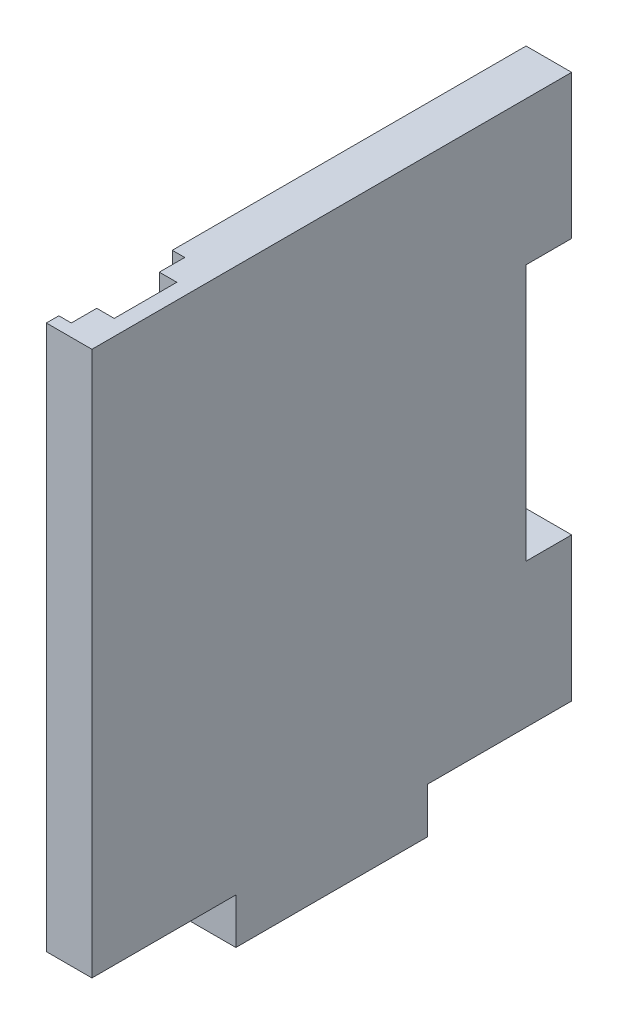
ISO-10303-21;
HEADER;
FILE_DESCRIPTION(('STEP AP214'),'2;1');
FILE_NAME('part.step','',(''),(''),'','','');
FILE_SCHEMA(('AUTOMOTIVE_DESIGN { 1 0 10303 214 1 1 1 1 }'));
ENDSEC;
DATA;
#1=APPLICATION_CONTEXT('core data for automotive mechanical design processes');
#2=APPLICATION_PROTOCOL_DEFINITION('international standard','automotive_design',2000,#1);
#3=PRODUCT_CONTEXT('',#1,'mechanical');
#4=PRODUCT('Part','Part','',(#3));
#5=PRODUCT_RELATED_PRODUCT_CATEGORY('part','',(#4));
#6=PRODUCT_DEFINITION_FORMATION('','',#4);
#7=PRODUCT_DEFINITION_CONTEXT('part definition',#1,'design');
#8=PRODUCT_DEFINITION('design','',#6,#7);
#9=PRODUCT_DEFINITION_SHAPE('','',#8);
#10=(LENGTH_UNIT() NAMED_UNIT(*) SI_UNIT(.MILLI.,.METRE.));
#11=(NAMED_UNIT(*) PLANE_ANGLE_UNIT() SI_UNIT($,.RADIAN.));
#12=(NAMED_UNIT(*) SI_UNIT($,.STERADIAN.) SOLID_ANGLE_UNIT());
#13=UNCERTAINTY_MEASURE_WITH_UNIT(LENGTH_MEASURE(1.E-05),#10,'distance_accuracy_value','');
#14=(GEOMETRIC_REPRESENTATION_CONTEXT(3) GLOBAL_UNCERTAINTY_ASSIGNED_CONTEXT((#13)) GLOBAL_UNIT_ASSIGNED_CONTEXT((#10,
#11,#12)) REPRESENTATION_CONTEXT('',''));
#15=CARTESIAN_POINT('',(0.,0.,0.));
#16=DIRECTION('',(0.,0.,1.));
#17=DIRECTION('',(1.,0.,0.));
#18=AXIS2_PLACEMENT_3D('',#15,#16,#17);
#19=CARTESIAN_POINT('',(-4.3,0.,0.));
#20=DIRECTION('',(-1.,0.,0.));
#21=DIRECTION('',(0.,0.,1.));
#22=AXIS2_PLACEMENT_3D('',#19,#20,#21);
#23=PLANE('',#22);
#24=DIRECTION('',(0.,1.,0.));
#25=VECTOR('',#24,1.);
#26=CARTESIAN_POINT('',(-4.3,0.,84.2));
#27=LINE('',#26,#25);
#28=CARTESIAN_POINT('',(-4.3,-104.,84.2));
#29=VERTEX_POINT('',#28);
#30=CARTESIAN_POINT('',(-4.3,123.,84.2));
#31=VERTEX_POINT('',#30);
#32=EDGE_CURVE('E11',#29,#31,#27,.T.);
#33=ORIENTED_EDGE('',*,*,#32,.F.);
#34=DIRECTION('',(0.,0.,1.));
#35=VECTOR('',#34,1.);
#36=CARTESIAN_POINT('',(-4.3,-104.,47.5000000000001));
#37=LINE('',#36,#35);
#38=CARTESIAN_POINT('',(-4.3,-104.,94.8000000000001));
#39=VERTEX_POINT('',#38);
#40=EDGE_CURVE('E203',#29,#39,#37,.T.);
#41=ORIENTED_EDGE('',*,*,#40,.T.);
#42=DIRECTION('',(0.,1.,0.));
#43=VECTOR('',#42,1.);
#44=CARTESIAN_POINT('',(-4.3,123.,94.8));
#45=LINE('',#44,#43);
#46=CARTESIAN_POINT('',(-4.3,123.,94.8));
#47=VERTEX_POINT('',#46);
#48=EDGE_CURVE('E207',#39,#47,#45,.T.);
#49=ORIENTED_EDGE('',*,*,#48,.T.);
#50=DIRECTION('',(0.,0.,-1.));
#51=VECTOR('',#50,1.);
#52=CARTESIAN_POINT('',(-4.3,123.,47.5));
#53=LINE('',#52,#51);
#54=EDGE_CURVE('E211',#47,#31,#53,.T.);
#55=ORIENTED_EDGE('',*,*,#54,.T.);
#56=EDGE_LOOP('',(#33,#41,#49,#55));
#57=FACE_BOUND('',#56,.T.);
#58=ADVANCED_FACE('F32',(#57),#23,.T.);
#59=CARTESIAN_POINT('',(-9.5,0.,0.));
#60=DIRECTION('',(1.,0.,0.));
#61=DIRECTION('',(0.,0.,-1.));
#62=AXIS2_PLACEMENT_3D('',#59,#60,#61);
#63=PLANE('',#62);
#64=DIRECTION('',(0.,0.,1.));
#65=VECTOR('',#64,1.);
#66=CARTESIAN_POINT('',(-9.5,-104.,100.));
#67=LINE('',#66,#65);
#68=CARTESIAN_POINT('',(-9.5,-104.,40.));
#69=VERTEX_POINT('',#68);
#70=CARTESIAN_POINT('',(-9.5,-104.,47.5000000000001));
#71=VERTEX_POINT('',#70);
#72=EDGE_CURVE('E229',#69,#71,#67,.T.);
#73=ORIENTED_EDGE('',*,*,#72,.T.);
#74=DIRECTION('',(0.,-1.,0.));
#75=VECTOR('',#74,1.);
#76=CARTESIAN_POINT('',(-9.5,123.,47.5));
#77=LINE('',#76,#75);
#78=CARTESIAN_POINT('',(-9.5,123.,47.5));
#79=VERTEX_POINT('',#78);
#80=EDGE_CURVE('E197',#79,#71,#77,.T.);
#81=ORIENTED_EDGE('',*,*,#80,.F.);
#82=DIRECTION('',(0.,0.,1.));
#83=VECTOR('',#82,1.);
#84=CARTESIAN_POINT('',(-9.5,123.,100.));
#85=LINE('',#84,#83);
#86=CARTESIAN_POINT('',(-9.5,123.,-100.));
#87=VERTEX_POINT('',#86);
#88=EDGE_CURVE('E302',#87,#79,#85,.T.);
#89=ORIENTED_EDGE('',*,*,#88,.F.);
#90=DIRECTION('',(0.,1.,0.));
#91=VECTOR('',#90,1.);
#92=CARTESIAN_POINT('',(-9.5,123.,-100.));
#93=LINE('',#92,#91);
#94=CARTESIAN_POINT('',(-9.5,63.,-100.));
#95=VERTEX_POINT('',#94);
#96=EDGE_CURVE('E287',#95,#87,#93,.T.);
#97=ORIENTED_EDGE('',*,*,#96,.F.);
#98=DIRECTION('',(0.,0.,-1.));
#99=VECTOR('',#98,1.);
#100=CARTESIAN_POINT('',(-9.5,63.,-100.));
#101=LINE('',#100,#99);
#102=CARTESIAN_POINT('',(-9.5,63.,-81.));
#103=VERTEX_POINT('',#102);
#104=EDGE_CURVE('E280',#103,#95,#101,.T.);
#105=ORIENTED_EDGE('',*,*,#104,.F.);
#106=DIRECTION('',(0.,1.,0.));
#107=VECTOR('',#106,1.);
#108=CARTESIAN_POINT('',(-9.5,63.,-81.));
#109=LINE('',#108,#107);
#110=CARTESIAN_POINT('',(-9.5,-44.,-81.));
#111=VERTEX_POINT('',#110);
#112=EDGE_CURVE('E262',#111,#103,#109,.T.);
#113=ORIENTED_EDGE('',*,*,#112,.F.);
#114=DIRECTION('',(0.,0.,1.));
#115=VECTOR('',#114,1.);
#116=CARTESIAN_POINT('',(-9.5,-44.,-100.));
#117=LINE('',#116,#115);
#118=CARTESIAN_POINT('',(-9.5,-44.,-100.));
#119=VERTEX_POINT('',#118);
#120=EDGE_CURVE('E264',#119,#111,#117,.T.);
#121=ORIENTED_EDGE('',*,*,#120,.F.);
#122=CARTESIAN_POINT('',(-9.5,-104.,-100.));
#123=VERTEX_POINT('',#122);
#124=EDGE_CURVE('E299',#123,#119,#93,.T.);
#125=ORIENTED_EDGE('',*,*,#124,.F.);
#126=DIRECTION('',(0.,0.,-1.));
#127=VECTOR('',#126,1.);
#128=CARTESIAN_POINT('',(-9.5,-104.,-100.));
#129=LINE('',#128,#127);
#130=CARTESIAN_POINT('',(-9.5,-104.,-40.));
#131=VERTEX_POINT('',#130);
#132=EDGE_CURVE('E257',#131,#123,#129,.T.);
#133=ORIENTED_EDGE('',*,*,#132,.F.);
#134=DIRECTION('',(0.,1.,0.));
#135=VECTOR('',#134,1.);
#136=CARTESIAN_POINT('',(-9.5,-123.,-40.));
#137=LINE('',#136,#135);
#138=CARTESIAN_POINT('',(-9.5,-123.,-40.));
#139=VERTEX_POINT('',#138);
#140=EDGE_CURVE('E242',#139,#131,#137,.T.);
#141=ORIENTED_EDGE('',*,*,#140,.F.);
#142=DIRECTION('',(0.,0.,-1.));
#143=VECTOR('',#142,1.);
#144=CARTESIAN_POINT('',(-9.5,-123.,100.));
#145=LINE('',#144,#143);
#146=CARTESIAN_POINT('',(-9.5,-123.,40.));
#147=VERTEX_POINT('',#146);
#148=EDGE_CURVE('E308',#147,#139,#145,.T.);
#149=ORIENTED_EDGE('',*,*,#148,.F.);
#150=DIRECTION('',(0.,1.,0.));
#151=VECTOR('',#150,1.);
#152=CARTESIAN_POINT('',(-9.5,-123.,40.));
#153=LINE('',#152,#151);
#154=EDGE_CURVE('E218',#147,#69,#153,.T.);
#155=ORIENTED_EDGE('',*,*,#154,.T.);
#156=EDGE_LOOP('',(#73,#81,#89,#97,#105,#113,#121,#125,#133,#141,#149,#155));
#157=FACE_BOUND('',#156,.T.);
#158=ADVANCED_FACE('F331',(#157),#63,.F.);
#159=CARTESIAN_POINT('',(9.5,123.,100.));
#160=DIRECTION('',(0.,0.,-1.));
#161=DIRECTION('',(0.,1.,0.));
#162=AXIS2_PLACEMENT_3D('',#159,#160,#161);
#163=PLANE('',#162);
#164=DIRECTION('',(1.,0.,0.));
#165=VECTOR('',#164,1.);
#166=CARTESIAN_POINT('',(-9.501,-104.,100.));
#167=LINE('',#166,#165);
#168=CARTESIAN_POINT('',(-9.5,-104.,100.));
#169=VERTEX_POINT('',#168);
#170=CARTESIAN_POINT('',(9.5,-104.,100.));
#171=VERTEX_POINT('',#170);
#172=EDGE_CURVE('E239',#169,#171,#167,.T.);
#173=ORIENTED_EDGE('',*,*,#172,.T.);
#174=DIRECTION('',(0.,-1.,0.));
#175=VECTOR('',#174,1.);
#176=CARTESIAN_POINT('',(9.5,123.,100.));
#177=LINE('',#176,#175);
#178=CARTESIAN_POINT('',(9.5,123.,100.));
#179=VERTEX_POINT('',#178);
#180=EDGE_CURVE('E293',#179,#171,#177,.T.);
#181=ORIENTED_EDGE('',*,*,#180,.F.);
#182=DIRECTION('',(-1.,0.,0.));
#183=VECTOR('',#182,1.);
#184=CARTESIAN_POINT('',(9.5,123.,100.));
#185=LINE('',#184,#183);
#186=CARTESIAN_POINT('',(-9.5,123.,100.));
#187=VERTEX_POINT('',#186);
#188=EDGE_CURVE('E298',#179,#187,#185,.T.);
#189=ORIENTED_EDGE('',*,*,#188,.T.);
#190=DIRECTION('',(0.,-1.,0.));
#191=VECTOR('',#190,1.);
#192=CARTESIAN_POINT('',(-9.5,123.,100.));
#193=LINE('',#192,#191);
#194=EDGE_CURVE('E305',#187,#169,#193,.T.);
#195=ORIENTED_EDGE('',*,*,#194,.T.);
#196=EDGE_LOOP('',(#173,#181,#189,#195));
#197=FACE_BOUND('',#196,.T.);
#198=ADVANCED_FACE('F336',(#197),#163,.F.);
#199=CARTESIAN_POINT('',(9.5,-123.,100.));
#200=DIRECTION('',(0.,1.,0.));
#201=DIRECTION('',(0.,0.,1.));
#202=AXIS2_PLACEMENT_3D('',#199,#200,#201);
#203=PLANE('',#202);
#204=DIRECTION('',(1.,0.,0.));
#205=VECTOR('',#204,1.);
#206=CARTESIAN_POINT('',(-9.501,-123.,40.));
#207=LINE('',#206,#205);
#208=CARTESIAN_POINT('',(9.5,-123.,40.));
#209=VERTEX_POINT('',#208);
#210=EDGE_CURVE('E238',#147,#209,#207,.T.);
#211=ORIENTED_EDGE('',*,*,#210,.F.);
#212=ORIENTED_EDGE('',*,*,#148,.T.);
#213=DIRECTION('',(1.,0.,0.));
#214=VECTOR('',#213,1.);
#215=CARTESIAN_POINT('',(-9.501,-123.,-40.));
#216=LINE('',#215,#214);
#217=CARTESIAN_POINT('',(9.5,-123.,-40.));
#218=VERTEX_POINT('',#217);
#219=EDGE_CURVE('E254',#139,#218,#216,.T.);
#220=ORIENTED_EDGE('',*,*,#219,.T.);
#221=DIRECTION('',(0.,0.,-1.));
#222=VECTOR('',#221,1.);
#223=CARTESIAN_POINT('',(9.5,-123.,100.));
#224=LINE('',#223,#222);
#225=EDGE_CURVE('E296',#209,#218,#224,.T.);
#226=ORIENTED_EDGE('',*,*,#225,.F.);
#227=EDGE_LOOP('',(#211,#212,#220,#226));
#228=FACE_BOUND('',#227,.T.);
#229=ADVANCED_FACE('F375',(#228),#203,.F.);
#230=CARTESIAN_POINT('',(9.5,0.,0.));
#231=DIRECTION('',(1.,0.,0.));
#232=DIRECTION('',(0.,0.,-1.));
#233=AXIS2_PLACEMENT_3D('',#230,#231,#232);
#234=PLANE('',#233);
#235=ORIENTED_EDGE('',*,*,#180,.T.);
#236=DIRECTION('',(0.,0.,-1.));
#237=VECTOR('',#236,1.);
#238=CARTESIAN_POINT('',(9.5,-104.,100.));
#239=LINE('',#238,#237);
#240=CARTESIAN_POINT('',(9.5,-104.,40.));
#241=VERTEX_POINT('',#240);
#242=EDGE_CURVE('E235',#171,#241,#239,.T.);
#243=ORIENTED_EDGE('',*,*,#242,.T.);
#244=DIRECTION('',(0.,-1.,0.));
#245=VECTOR('',#244,1.);
#246=CARTESIAN_POINT('',(9.5,-123.,40.));
#247=LINE('',#246,#245);
#248=EDGE_CURVE('E232',#241,#209,#247,.T.);
#249=ORIENTED_EDGE('',*,*,#248,.T.);
#250=ORIENTED_EDGE('',*,*,#225,.T.);
#251=DIRECTION('',(0.,-1.,0.));
#252=VECTOR('',#251,1.);
#253=CARTESIAN_POINT('',(9.5,-123.,-40.));
#254=LINE('',#253,#252);
#255=CARTESIAN_POINT('',(9.5,-104.,-40.));
#256=VERTEX_POINT('',#255);
#257=EDGE_CURVE('E250',#256,#218,#254,.T.);
#258=ORIENTED_EDGE('',*,*,#257,.F.);
#259=DIRECTION('',(0.,0.,1.));
#260=VECTOR('',#259,1.);
#261=CARTESIAN_POINT('',(9.5,-104.,-100.));
#262=LINE('',#261,#260);
#263=CARTESIAN_POINT('',(9.5,-104.,-100.));
#264=VERTEX_POINT('',#263);
#265=EDGE_CURVE('E247',#264,#256,#262,.T.);
#266=ORIENTED_EDGE('',*,*,#265,.F.);
#267=DIRECTION('',(0.,1.,0.));
#268=VECTOR('',#267,1.);
#269=CARTESIAN_POINT('',(9.5,123.,-100.));
#270=LINE('',#269,#268);
#271=CARTESIAN_POINT('',(9.5,-44.,-100.));
#272=VERTEX_POINT('',#271);
#273=EDGE_CURVE('E288',#264,#272,#270,.T.);
#274=ORIENTED_EDGE('',*,*,#273,.T.);
#275=DIRECTION('',(0.,0.,-1.));
#276=VECTOR('',#275,1.);
#277=CARTESIAN_POINT('',(9.5,-44.,-100.));
#278=LINE('',#277,#276);
#279=CARTESIAN_POINT('',(9.5,-44.,-81.));
#280=VERTEX_POINT('',#279);
#281=EDGE_CURVE('E273',#280,#272,#278,.T.);
#282=ORIENTED_EDGE('',*,*,#281,.F.);
#283=DIRECTION('',(0.,-1.,0.));
#284=VECTOR('',#283,1.);
#285=CARTESIAN_POINT('',(9.5,63.,-81.));
#286=LINE('',#285,#284);
#287=CARTESIAN_POINT('',(9.5,63.,-81.));
#288=VERTEX_POINT('',#287);
#289=EDGE_CURVE('E270',#288,#280,#286,.T.);
#290=ORIENTED_EDGE('',*,*,#289,.F.);
#291=DIRECTION('',(0.,0.,1.));
#292=VECTOR('',#291,1.);
#293=CARTESIAN_POINT('',(9.5,63.,-100.));
#294=LINE('',#293,#292);
#295=CARTESIAN_POINT('',(9.5,63.,-100.));
#296=VERTEX_POINT('',#295);
#297=EDGE_CURVE('E267',#296,#288,#294,.T.);
#298=ORIENTED_EDGE('',*,*,#297,.F.);
#299=CARTESIAN_POINT('',(9.5,123.,-100.));
#300=VERTEX_POINT('',#299);
#301=EDGE_CURVE('E291',#296,#300,#270,.T.);
#302=ORIENTED_EDGE('',*,*,#301,.T.);
#303=DIRECTION('',(0.,0.,1.));
#304=VECTOR('',#303,1.);
#305=CARTESIAN_POINT('',(9.5,123.,100.));
#306=LINE('',#305,#304);
#307=EDGE_CURVE('E290',#300,#179,#306,.T.);
#308=ORIENTED_EDGE('',*,*,#307,.T.);
#309=EDGE_LOOP('',(#235,#243,#249,#250,#258,#266,#274,#282,#290,#298,#302,#308));
#310=FACE_BOUND('',#309,.T.);
#311=ADVANCED_FACE('F354',(#310),#234,.T.);
#312=CARTESIAN_POINT('',(-9.5,123.,94.8));
#313=VERTEX_POINT('',#312);
#314=EDGE_CURVE('E301',#313,#187,#85,.T.);
#315=ORIENTED_EDGE('',*,*,#314,.F.);
#316=DIRECTION('',(0.,1.,0.));
#317=VECTOR('',#316,1.);
#318=CARTESIAN_POINT('',(-9.5,123.,94.8));
#319=LINE('',#318,#317);
#320=CARTESIAN_POINT('',(-9.5,-104.,94.8000000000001));
#321=VERTEX_POINT('',#320);
#322=EDGE_CURVE('E204',#321,#313,#319,.T.);
#323=ORIENTED_EDGE('',*,*,#322,.F.);
#324=EDGE_CURVE('E228',#321,#169,#67,.T.);
#325=ORIENTED_EDGE('',*,*,#324,.T.);
#326=ORIENTED_EDGE('',*,*,#194,.F.);
#327=EDGE_LOOP('',(#315,#323,#325,#326));
#328=FACE_BOUND('',#327,.T.);
#329=ADVANCED_FACE('F339',(#328),#63,.F.);
#330=CARTESIAN_POINT('',(9.5,123.,-100.));
#331=DIRECTION('',(0.,0.,1.));
#332=DIRECTION('',(0.,-1.,0.));
#333=AXIS2_PLACEMENT_3D('',#330,#331,#332);
#334=PLANE('',#333);
#335=ORIENTED_EDGE('',*,*,#273,.F.);
#336=DIRECTION('',(1.,0.,0.));
#337=VECTOR('',#336,1.);
#338=CARTESIAN_POINT('',(-9.501,-104.,-100.));
#339=LINE('',#338,#337);
#340=EDGE_CURVE('E253',#123,#264,#339,.T.);
#341=ORIENTED_EDGE('',*,*,#340,.F.);
#342=ORIENTED_EDGE('',*,*,#124,.T.);
#343=DIRECTION('',(1.,0.,0.));
#344=VECTOR('',#343,1.);
#345=CARTESIAN_POINT('',(-9.501,-44.,-100.));
#346=LINE('',#345,#344);
#347=EDGE_CURVE('E277',#119,#272,#346,.T.);
#348=ORIENTED_EDGE('',*,*,#347,.T.);
#349=EDGE_LOOP('',(#335,#341,#342,#348));
#350=FACE_BOUND('',#349,.T.);
#351=ADVANCED_FACE('F389',(#350),#334,.F.);
#352=ORIENTED_EDGE('',*,*,#301,.F.);
#353=DIRECTION('',(1.,0.,0.));
#354=VECTOR('',#353,1.);
#355=CARTESIAN_POINT('',(-9.501,63.,-100.));
#356=LINE('',#355,#354);
#357=EDGE_CURVE('E276',#95,#296,#356,.T.);
#358=ORIENTED_EDGE('',*,*,#357,.F.);
#359=ORIENTED_EDGE('',*,*,#96,.T.);
#360=DIRECTION('',(-1.,0.,0.));
#361=VECTOR('',#360,1.);
#362=CARTESIAN_POINT('',(9.5,123.,-100.));
#363=LINE('',#362,#361);
#364=EDGE_CURVE('E312',#300,#87,#363,.T.);
#365=ORIENTED_EDGE('',*,*,#364,.F.);
#366=EDGE_LOOP('',(#352,#358,#359,#365));
#367=FACE_BOUND('',#366,.T.);
#368=ADVANCED_FACE('F34',(#367),#334,.F.);
#369=CARTESIAN_POINT('',(9.5,123.,100.));
#370=DIRECTION('',(0.,-1.,0.));
#371=DIRECTION('',(0.,0.,-1.));
#372=AXIS2_PLACEMENT_3D('',#369,#370,#371);
#373=PLANE('',#372);
#374=DIRECTION('',(0.,0.,-1.));
#375=VECTOR('',#374,1.);
#376=CARTESIAN_POINT('',(3.,123.,84.2));
#377=LINE('',#376,#375);
#378=CARTESIAN_POINT('',(3.,123.,84.2));
#379=VERTEX_POINT('',#378);
#380=CARTESIAN_POINT('',(3.,123.,58.1));
#381=VERTEX_POINT('',#380);
#382=EDGE_CURVE('E184',#379,#381,#377,.T.);
#383=ORIENTED_EDGE('',*,*,#382,.F.);
#384=DIRECTION('',(-1.,0.,0.));
#385=VECTOR('',#384,1.);
#386=CARTESIAN_POINT('',(3.,123.,84.2));
#387=LINE('',#386,#385);
#388=EDGE_CURVE('E168',#379,#31,#387,.T.);
#389=ORIENTED_EDGE('',*,*,#388,.T.);
#390=ORIENTED_EDGE('',*,*,#54,.F.);
#391=DIRECTION('',(-1.,0.,0.));
#392=VECTOR('',#391,1.);
#393=CARTESIAN_POINT('',(-4.3,123.,94.8));
#394=LINE('',#393,#392);
#395=EDGE_CURVE('E219',#47,#313,#394,.T.);
#396=ORIENTED_EDGE('',*,*,#395,.T.);
#397=ORIENTED_EDGE('',*,*,#314,.T.);
#398=ORIENTED_EDGE('',*,*,#188,.F.);
#399=ORIENTED_EDGE('',*,*,#307,.F.);
#400=ORIENTED_EDGE('',*,*,#364,.T.);
#401=ORIENTED_EDGE('',*,*,#88,.T.);
#402=DIRECTION('',(-1.,0.,0.));
#403=VECTOR('',#402,1.);
#404=CARTESIAN_POINT('',(-4.3,123.,47.5));
#405=LINE('',#404,#403);
#406=CARTESIAN_POINT('',(-4.3,123.,47.5));
#407=VERTEX_POINT('',#406);
#408=EDGE_CURVE('E216',#407,#79,#405,.T.);
#409=ORIENTED_EDGE('',*,*,#408,.F.);
#410=CARTESIAN_POINT('',(-4.3,123.,58.1));
#411=VERTEX_POINT('',#410);
#412=EDGE_CURVE('E210',#411,#407,#53,.T.);
#413=ORIENTED_EDGE('',*,*,#412,.F.);
#414=DIRECTION('',(-1.,0.,0.));
#415=VECTOR('',#414,1.);
#416=CARTESIAN_POINT('',(3.,123.,58.1));
#417=LINE('',#416,#415);
#418=EDGE_CURVE('E47',#381,#411,#417,.T.);
#419=ORIENTED_EDGE('',*,*,#418,.F.);
#420=EDGE_LOOP('',(#383,#389,#390,#396,#397,#398,#399,#400,#401,#409,#413,#419));
#421=FACE_BOUND('',#420,.T.);
#422=ADVANCED_FACE('F188',(#421),#373,.F.);
#423=CARTESIAN_POINT('',(-9.501,-44.,-100.));
#424=DIRECTION('',(0.,-1.,0.));
#425=DIRECTION('',(0.,0.,-1.));
#426=AXIS2_PLACEMENT_3D('',#423,#424,#425);
#427=PLANE('',#426);
#428=ORIENTED_EDGE('',*,*,#120,.T.);
#429=DIRECTION('',(1.,0.,0.));
#430=VECTOR('',#429,1.);
#431=CARTESIAN_POINT('',(-9.501,-44.,-81.));
#432=LINE('',#431,#430);
#433=EDGE_CURVE('E281',#111,#280,#432,.T.);
#434=ORIENTED_EDGE('',*,*,#433,.T.);
#435=ORIENTED_EDGE('',*,*,#281,.T.);
#436=ORIENTED_EDGE('',*,*,#347,.F.);
#437=EDGE_LOOP('',(#428,#434,#435,#436));
#438=FACE_BOUND('',#437,.T.);
#439=ADVANCED_FACE('F394',(#438),#427,.F.);
#440=CARTESIAN_POINT('',(-9.501,63.,-81.));
#441=DIRECTION('',(0.,0.,1.));
#442=DIRECTION('',(0.,-1.,0.));
#443=AXIS2_PLACEMENT_3D('',#440,#441,#442);
#444=PLANE('',#443);
#445=ORIENTED_EDGE('',*,*,#112,.T.);
#446=DIRECTION('',(1.,0.,0.));
#447=VECTOR('',#446,1.);
#448=CARTESIAN_POINT('',(-9.501,63.,-81.));
#449=LINE('',#448,#447);
#450=EDGE_CURVE('E283',#103,#288,#449,.T.);
#451=ORIENTED_EDGE('',*,*,#450,.T.);
#452=ORIENTED_EDGE('',*,*,#289,.T.);
#453=ORIENTED_EDGE('',*,*,#433,.F.);
#454=EDGE_LOOP('',(#445,#451,#452,#453));
#455=FACE_BOUND('',#454,.T.);
#456=ADVANCED_FACE('F398',(#455),#444,.F.);
#457=CARTESIAN_POINT('',(-9.501,63.,-100.));
#458=DIRECTION('',(0.,1.,0.));
#459=DIRECTION('',(0.,0.,1.));
#460=AXIS2_PLACEMENT_3D('',#457,#458,#459);
#461=PLANE('',#460);
#462=ORIENTED_EDGE('',*,*,#104,.T.);
#463=ORIENTED_EDGE('',*,*,#357,.T.);
#464=ORIENTED_EDGE('',*,*,#297,.T.);
#465=ORIENTED_EDGE('',*,*,#450,.F.);
#466=EDGE_LOOP('',(#462,#463,#464,#465));
#467=FACE_BOUND('',#466,.T.);
#468=ADVANCED_FACE('F400',(#467),#461,.F.);
#469=CARTESIAN_POINT('',(-9.501,-123.,-40.));
#470=DIRECTION('',(0.,0.,1.));
#471=DIRECTION('',(1.,0.,0.));
#472=AXIS2_PLACEMENT_3D('',#469,#470,#471);
#473=PLANE('',#472);
#474=ORIENTED_EDGE('',*,*,#140,.T.);
#475=DIRECTION('',(1.,0.,0.));
#476=VECTOR('',#475,1.);
#477=CARTESIAN_POINT('',(-9.501,-104.,-40.));
#478=LINE('',#477,#476);
#479=EDGE_CURVE('E258',#131,#256,#478,.T.);
#480=ORIENTED_EDGE('',*,*,#479,.T.);
#481=ORIENTED_EDGE('',*,*,#257,.T.);
#482=ORIENTED_EDGE('',*,*,#219,.F.);
#483=EDGE_LOOP('',(#474,#480,#481,#482));
#484=FACE_BOUND('',#483,.T.);
#485=ADVANCED_FACE('F380',(#484),#473,.F.);
#486=CARTESIAN_POINT('',(-9.501,-104.,-100.));
#487=DIRECTION('',(0.,1.,0.));
#488=DIRECTION('',(0.,0.,1.));
#489=AXIS2_PLACEMENT_3D('',#486,#487,#488);
#490=PLANE('',#489);
#491=ORIENTED_EDGE('',*,*,#132,.T.);
#492=ORIENTED_EDGE('',*,*,#340,.T.);
#493=ORIENTED_EDGE('',*,*,#265,.T.);
#494=ORIENTED_EDGE('',*,*,#479,.F.);
#495=EDGE_LOOP('',(#491,#492,#493,#494));
#496=FACE_BOUND('',#495,.T.);
#497=ADVANCED_FACE('F384',(#496),#490,.F.);
#498=CARTESIAN_POINT('',(-9.501,-104.,100.));
#499=DIRECTION('',(0.,-1.,0.));
#500=DIRECTION('',(0.,0.,-1.));
#501=AXIS2_PLACEMENT_3D('',#498,#499,#500);
#502=PLANE('',#501);
#503=DIRECTION('',(-1.,0.,0.));
#504=VECTOR('',#503,1.);
#505=CARTESIAN_POINT('',(3.,-104.,84.2));
#506=LINE('',#505,#504);
#507=CARTESIAN_POINT('',(3.,-104.,84.2));
#508=VERTEX_POINT('',#507);
#509=EDGE_CURVE('E195',#508,#29,#506,.T.);
#510=ORIENTED_EDGE('',*,*,#509,.F.);
#511=DIRECTION('',(0.,0.,1.));
#512=VECTOR('',#511,1.);
#513=CARTESIAN_POINT('',(3.,-104.,84.2));
#514=LINE('',#513,#512);
#515=CARTESIAN_POINT('',(3.,-104.,58.1000000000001));
#516=VERTEX_POINT('',#515);
#517=EDGE_CURVE('E178',#516,#508,#514,.T.);
#518=ORIENTED_EDGE('',*,*,#517,.F.);
#519=DIRECTION('',(-1.,0.,0.));
#520=VECTOR('',#519,1.);
#521=CARTESIAN_POINT('',(3.,-104.,58.1000000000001));
#522=LINE('',#521,#520);
#523=CARTESIAN_POINT('',(-4.3,-104.,58.1000000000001));
#524=VERTEX_POINT('',#523);
#525=EDGE_CURVE('E198',#516,#524,#522,.T.);
#526=ORIENTED_EDGE('',*,*,#525,.T.);
#527=CARTESIAN_POINT('',(-4.3,-104.,47.5));
#528=VERTEX_POINT('',#527);
#529=EDGE_CURVE('E205',#528,#524,#37,.T.);
#530=ORIENTED_EDGE('',*,*,#529,.F.);
#531=DIRECTION('',(-1.,0.,0.));
#532=VECTOR('',#531,1.);
#533=CARTESIAN_POINT('',(-4.3,-104.,47.5000000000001));
#534=LINE('',#533,#532);
#535=EDGE_CURVE('E213',#528,#71,#534,.T.);
#536=ORIENTED_EDGE('',*,*,#535,.T.);
#537=ORIENTED_EDGE('',*,*,#72,.F.);
#538=DIRECTION('',(1.,0.,0.));
#539=VECTOR('',#538,1.);
#540=CARTESIAN_POINT('',(-9.501,-104.,40.));
#541=LINE('',#540,#539);
#542=EDGE_CURVE('E243',#69,#241,#541,.T.);
#543=ORIENTED_EDGE('',*,*,#542,.T.);
#544=ORIENTED_EDGE('',*,*,#242,.F.);
#545=ORIENTED_EDGE('',*,*,#172,.F.);
#546=ORIENTED_EDGE('',*,*,#324,.F.);
#547=DIRECTION('',(-1.,0.,0.));
#548=VECTOR('',#547,1.);
#549=CARTESIAN_POINT('',(-4.3,-104.,94.8000000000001));
#550=LINE('',#549,#548);
#551=EDGE_CURVE('E222',#39,#321,#550,.T.);
#552=ORIENTED_EDGE('',*,*,#551,.F.);
#553=ORIENTED_EDGE('',*,*,#40,.F.);
#554=EDGE_LOOP('',(#510,#518,#526,#530,#536,#537,#543,#544,#545,#546,#552,#553));
#555=FACE_BOUND('',#554,.T.);
#556=ADVANCED_FACE('F317',(#555),#502,.T.);
#557=CARTESIAN_POINT('',(-9.501,-123.,40.));
#558=DIRECTION('',(0.,0.,1.));
#559=DIRECTION('',(1.,0.,0.));
#560=AXIS2_PLACEMENT_3D('',#557,#558,#559);
#561=PLANE('',#560);
#562=ORIENTED_EDGE('',*,*,#210,.T.);
#563=ORIENTED_EDGE('',*,*,#248,.F.);
#564=ORIENTED_EDGE('',*,*,#542,.F.);
#565=ORIENTED_EDGE('',*,*,#154,.F.);
#566=EDGE_LOOP('',(#562,#563,#564,#565));
#567=FACE_BOUND('',#566,.T.);
#568=ADVANCED_FACE('F371',(#567),#561,.T.);
#569=CARTESIAN_POINT('',(-4.3,123.,47.5));
#570=DIRECTION('',(0.,0.,-1.));
#571=DIRECTION('',(0.,1.,0.));
#572=AXIS2_PLACEMENT_3D('',#569,#570,#571);
#573=PLANE('',#572);
#574=ORIENTED_EDGE('',*,*,#80,.T.);
#575=ORIENTED_EDGE('',*,*,#535,.F.);
#576=DIRECTION('',(0.,-1.,0.));
#577=VECTOR('',#576,1.);
#578=CARTESIAN_POINT('',(-4.3,123.,47.5));
#579=LINE('',#578,#577);
#580=EDGE_CURVE('E55',#407,#528,#579,.T.);
#581=ORIENTED_EDGE('',*,*,#580,.F.);
#582=ORIENTED_EDGE('',*,*,#408,.T.);
#583=EDGE_LOOP('',(#574,#575,#581,#582));
#584=FACE_BOUND('',#583,.T.);
#585=ADVANCED_FACE('F327',(#584),#573,.F.);
#586=CARTESIAN_POINT('',(-4.3,123.,94.8));
#587=DIRECTION('',(0.,0.,1.));
#588=DIRECTION('',(0.,-1.,0.));
#589=AXIS2_PLACEMENT_3D('',#586,#587,#588);
#590=PLANE('',#589);
#591=ORIENTED_EDGE('',*,*,#322,.T.);
#592=ORIENTED_EDGE('',*,*,#395,.F.);
#593=ORIENTED_EDGE('',*,*,#48,.F.);
#594=ORIENTED_EDGE('',*,*,#551,.T.);
#595=EDGE_LOOP('',(#591,#592,#593,#594));
#596=FACE_BOUND('',#595,.T.);
#597=ADVANCED_FACE('F320',(#596),#590,.F.);
#598=DIRECTION('',(0.,-1.,0.));
#599=VECTOR('',#598,1.);
#600=CARTESIAN_POINT('',(-4.3,0.,58.1));
#601=LINE('',#600,#599);
#602=EDGE_CURVE('E40',#411,#524,#601,.T.);
#603=ORIENTED_EDGE('',*,*,#602,.F.);
#604=ORIENTED_EDGE('',*,*,#412,.T.);
#605=ORIENTED_EDGE('',*,*,#580,.T.);
#606=ORIENTED_EDGE('',*,*,#529,.T.);
#607=EDGE_LOOP('',(#603,#604,#605,#606));
#608=FACE_BOUND('',#607,.T.);
#609=ADVANCED_FACE('F318',(#608),#23,.T.);
#610=CARTESIAN_POINT('',(3.,123.,84.2));
#611=DIRECTION('',(0.,0.,1.));
#612=DIRECTION('',(0.,-1.,0.));
#613=AXIS2_PLACEMENT_3D('',#610,#611,#612);
#614=PLANE('',#613);
#615=ORIENTED_EDGE('',*,*,#32,.T.);
#616=ORIENTED_EDGE('',*,*,#388,.F.);
#617=DIRECTION('',(0.,1.,0.));
#618=VECTOR('',#617,1.);
#619=CARTESIAN_POINT('',(3.,123.,84.2));
#620=LINE('',#619,#618);
#621=EDGE_CURVE('E171',#508,#379,#620,.T.);
#622=ORIENTED_EDGE('',*,*,#621,.F.);
#623=ORIENTED_EDGE('',*,*,#509,.T.);
#624=EDGE_LOOP('',(#615,#616,#622,#623));
#625=FACE_BOUND('',#624,.T.);
#626=ADVANCED_FACE('F170',(#625),#614,.F.);
#627=CARTESIAN_POINT('',(3.,123.,58.1));
#628=DIRECTION('',(0.,0.,-1.));
#629=DIRECTION('',(0.,1.,0.));
#630=AXIS2_PLACEMENT_3D('',#627,#628,#629);
#631=PLANE('',#630);
#632=ORIENTED_EDGE('',*,*,#602,.T.);
#633=ORIENTED_EDGE('',*,*,#525,.F.);
#634=DIRECTION('',(0.,-1.,0.));
#635=VECTOR('',#634,1.);
#636=CARTESIAN_POINT('',(3.,123.,58.1));
#637=LINE('',#636,#635);
#638=EDGE_CURVE('E190',#381,#516,#637,.T.);
#639=ORIENTED_EDGE('',*,*,#638,.F.);
#640=ORIENTED_EDGE('',*,*,#418,.T.);
#641=EDGE_LOOP('',(#632,#633,#639,#640));
#642=FACE_BOUND('',#641,.T.);
#643=ADVANCED_FACE('F314',(#642),#631,.F.);
#644=CARTESIAN_POINT('',(3.,0.,0.));
#645=DIRECTION('',(1.,0.,0.));
#646=DIRECTION('',(0.,0.,-1.));
#647=AXIS2_PLACEMENT_3D('',#644,#645,#646);
#648=PLANE('',#647);
#649=ORIENTED_EDGE('',*,*,#621,.T.);
#650=ORIENTED_EDGE('',*,*,#382,.T.);
#651=ORIENTED_EDGE('',*,*,#638,.T.);
#652=ORIENTED_EDGE('',*,*,#517,.T.);
#653=EDGE_LOOP('',(#649,#650,#651,#652));
#654=FACE_BOUND('',#653,.T.);
#655=ADVANCED_FACE('F182',(#654),#648,.F.);
#656=CLOSED_SHELL('',(#58,#158,#198,#229,#311,#329,#351,#368,#422,#439,#456,#468,#485,#497,#556,
#568,#585,#597,#609,#626,#643,#655));
#657=MANIFOLD_SOLID_BREP('B2',#656);
#658=ADVANCED_BREP_SHAPE_REPRESENTATION('',(#18,#657),#14);
#659=SHAPE_DEFINITION_REPRESENTATION(#9,#658);
ENDSEC;
END-ISO-10303-21;
